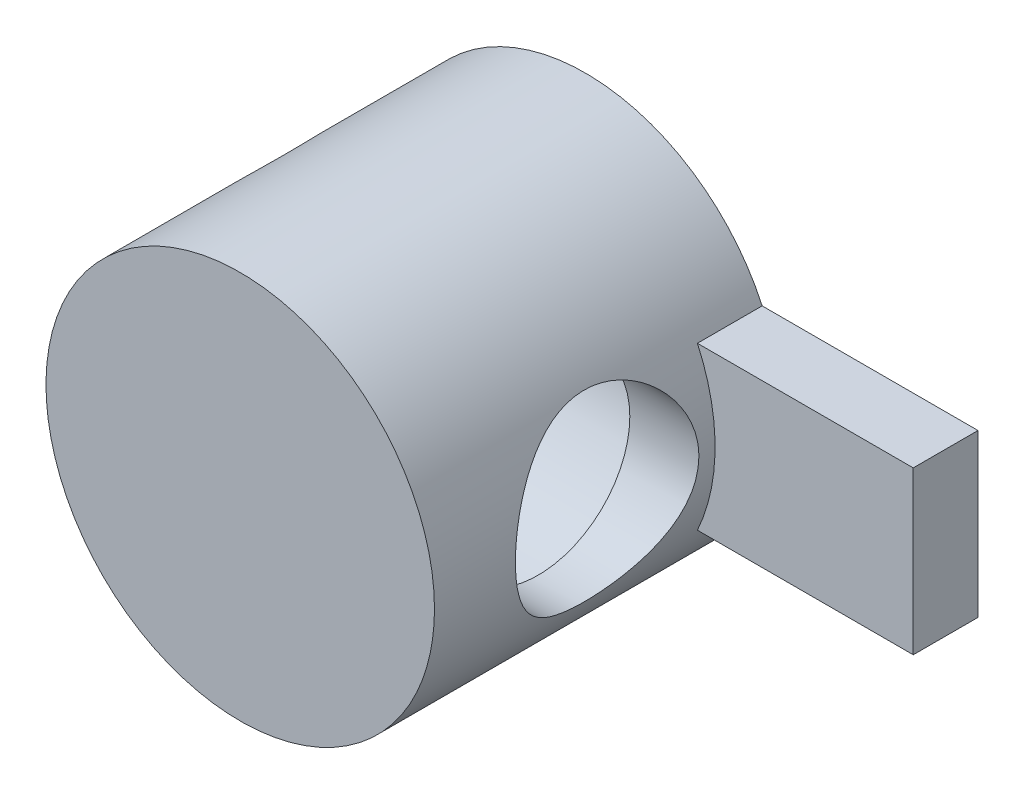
from build123d import *

# Parameters (mm, degrees)
SKETCH_1_R          = 9
EXTRUDE_1_DEPTH     = 8
EXTRUDE_START       = -3
EXTRUDE_2_DEPTH     = 3
SKETCH_4_R          = 4.25
CUT_EXTRUDE_1_DEPTH = 10
SKETCH_5_R          = 6.75
CUT_EXTRUDE_2_DEPTH = 20
CUT_EXTRUDE_START   = 5.8
SKETCH_6_R          = 6.75
CUT_EXTRUDE_3_DEPTH = 5.8


with BuildPart() as part:
    # Sketch 1 → Extrude 1 (new, symmetric)
    with BuildSketch(Plane.XY):
        Circle(SKETCH_1_R)
    extrude(amount=EXTRUDE_1_DEPTH, both=True)

    # Sketch 3 → Extrude 2 (add)
    with BuildSketch(Plane(origin=(0, 0, -8), x_dir=(-1, 0, 0), z_dir=(0, 0, -1)).offset(EXTRUDE_START)):
        with BuildLine():
            Line((-8.181534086, 3.75), (-18.181534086, 3.75))
            Line((-18.181534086, 3.75), (-18.181534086, -3.75))
            Line((-18.181534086, -3.75), (-8.181534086, -3.75))
            ThreePointArc((-8.181534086, -3.75), (-9, 0), (-8.181534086, 3.75))
        make_face()
    extrude(amount=EXTRUDE_2_DEPTH)

    # Sketch 4 → Cut-Extrude 1 (cut, symmetric)
    with BuildSketch(Plane(origin=(0, 0, 0), x_dir=(0, 0, -1), z_dir=(1, 0, 0))):
        Circle(SKETCH_4_R)
    extrude(amount=CUT_EXTRUDE_1_DEPTH, both=True, mode=Mode.SUBTRACT)

    # Sketch 5 → Cut-Extrude 2 (cut)
    with BuildSketch(Plane(origin=(0, 0, 0), x_dir=(0, 0, -1), z_dir=(1, 0, 0))):
        Circle(SKETCH_5_R)
    extrude(amount=-CUT_EXTRUDE_2_DEPTH, mode=Mode.SUBTRACT)

    # Sketch 6 → Cut-Extrude 3 (cut)
    with BuildSketch(Plane(origin=(0, 0, 0), x_dir=(0, 0, -1), z_dir=(1, 0, 0)).offset(CUT_EXTRUDE_START)):
        Circle(SKETCH_6_R)
    extrude(amount=-CUT_EXTRUDE_3_DEPTH, mode=Mode.SUBTRACT)


solid = part.part
